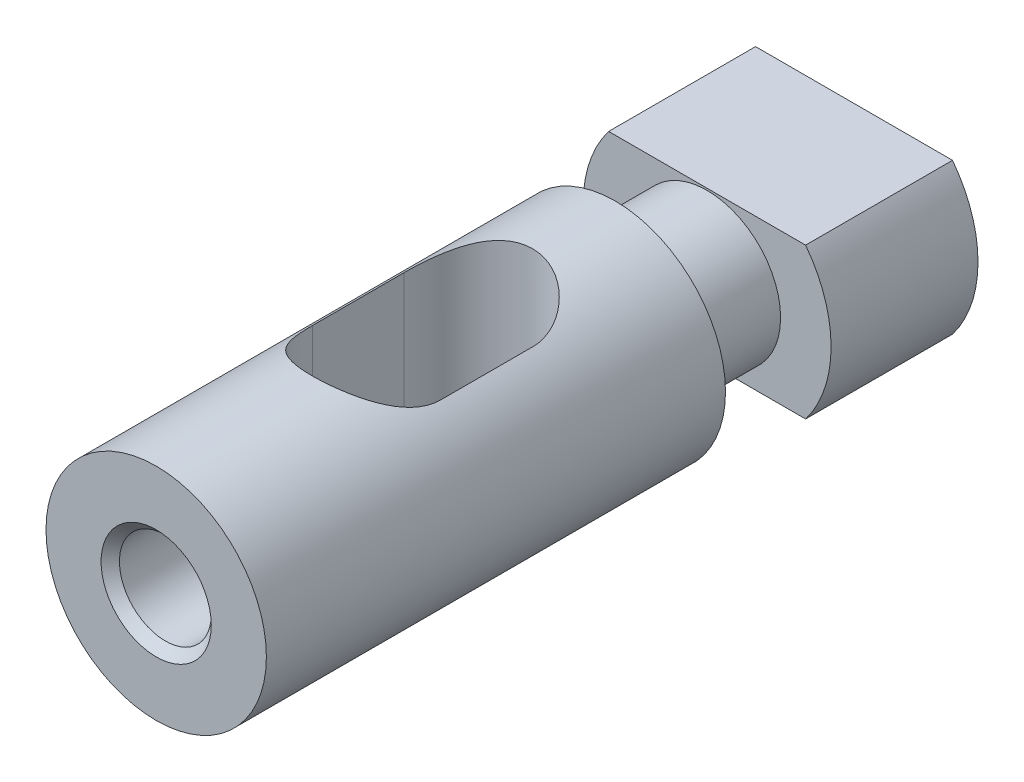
ISO-10303-21;
HEADER;
FILE_DESCRIPTION(('STEP AP214'),'2;1');
FILE_NAME('part.step','',(''),(''),'','','');
FILE_SCHEMA(('AUTOMOTIVE_DESIGN { 1 0 10303 214 1 1 1 1 }'));
ENDSEC;
DATA;
#1=APPLICATION_CONTEXT('core data for automotive mechanical design processes');
#2=APPLICATION_PROTOCOL_DEFINITION('international standard','automotive_design',2000,#1);
#3=PRODUCT_CONTEXT('',#1,'mechanical');
#4=PRODUCT('Part','Part','',(#3));
#5=PRODUCT_RELATED_PRODUCT_CATEGORY('part','',(#4));
#6=PRODUCT_DEFINITION_FORMATION('','',#4);
#7=PRODUCT_DEFINITION_CONTEXT('part definition',#1,'design');
#8=PRODUCT_DEFINITION('design','',#6,#7);
#9=PRODUCT_DEFINITION_SHAPE('','',#8);
#10=(LENGTH_UNIT() NAMED_UNIT(*) SI_UNIT(.MILLI.,.METRE.));
#11=(NAMED_UNIT(*) PLANE_ANGLE_UNIT() SI_UNIT($,.RADIAN.));
#12=(NAMED_UNIT(*) SI_UNIT($,.STERADIAN.) SOLID_ANGLE_UNIT());
#13=UNCERTAINTY_MEASURE_WITH_UNIT(LENGTH_MEASURE(1.E-05),#10,'distance_accuracy_value','');
#14=(GEOMETRIC_REPRESENTATION_CONTEXT(3) GLOBAL_UNCERTAINTY_ASSIGNED_CONTEXT((#13)) GLOBAL_UNIT_ASSIGNED_CONTEXT((#10,
#11,#12)) REPRESENTATION_CONTEXT('',''));
#15=CARTESIAN_POINT('',(0.,0.,0.));
#16=DIRECTION('',(0.,0.,1.));
#17=DIRECTION('',(1.,0.,0.));
#18=AXIS2_PLACEMENT_3D('',#15,#16,#17);
#19=CARTESIAN_POINT('',(0.,-13.,-24.82));
#20=DIRECTION('',(0.,0.,-1.));
#21=DIRECTION('',(-1.,0.,0.));
#22=AXIS2_PLACEMENT_3D('',#19,#20,#21);
#23=PLANE('',#22);
#24=DIRECTION('',(1.,0.,0.));
#25=VECTOR('',#24,1.);
#26=CARTESIAN_POINT('',(0.,-17.1,-24.82));
#27=LINE('',#26,#25);
#28=CARTESIAN_POINT('',(-5.36213576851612,-17.1,-24.82));
#29=VERTEX_POINT('',#28);
#30=CARTESIAN_POINT('',(5.36213576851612,-17.1,-24.82));
#31=VERTEX_POINT('',#30);
#32=EDGE_CURVE('E177',#29,#31,#27,.T.);
#33=ORIENTED_EDGE('',*,*,#32,.F.);
#34=CARTESIAN_POINT('',(0.,-13.,-24.82));
#35=DIRECTION('',(0.,0.,1.));
#36=DIRECTION('',(1.,0.,0.));
#37=AXIS2_PLACEMENT_3D('',#34,#35,#36);
#38=CIRCLE('',#37,6.75);
#39=CARTESIAN_POINT('',(-5.36213576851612,-8.9,-24.82));
#40=VERTEX_POINT('',#39);
#41=EDGE_CURVE('E183',#40,#29,#38,.T.);
#42=ORIENTED_EDGE('',*,*,#41,.F.);
#43=DIRECTION('',(1.,0.,0.));
#44=VECTOR('',#43,1.);
#45=CARTESIAN_POINT('',(0.,-8.9,-24.82));
#46=LINE('',#45,#44);
#47=CARTESIAN_POINT('',(5.36213576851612,-8.9,-24.82));
#48=VERTEX_POINT('',#47);
#49=EDGE_CURVE('E187',#48,#40,#46,.F.);
#50=ORIENTED_EDGE('',*,*,#49,.F.);
#51=CARTESIAN_POINT('',(0.,-13.,-24.82));
#52=DIRECTION('',(0.,0.,1.));
#53=DIRECTION('',(1.,0.,0.));
#54=AXIS2_PLACEMENT_3D('',#51,#52,#53);
#55=CIRCLE('',#54,6.75);
#56=EDGE_CURVE('E172',#31,#48,#55,.T.);
#57=ORIENTED_EDGE('',*,*,#56,.F.);
#58=EDGE_LOOP('',(#33,#42,#50,#57));
#59=FACE_BOUND('',#58,.T.);
#60=ADVANCED_FACE('F32',(#59),#23,.T.);
#61=CARTESIAN_POINT('',(0.,-8.9,-20.82));
#62=DIRECTION('',(0.,1.,0.));
#63=DIRECTION('',(0.,0.,1.));
#64=AXIS2_PLACEMENT_3D('',#61,#62,#63);
#65=PLANE('',#64);
#66=DIRECTION('',(0.,0.,1.));
#67=VECTOR('',#66,1.);
#68=CARTESIAN_POINT('',(-5.36213576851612,-8.9,-20.82));
#69=LINE('',#68,#67);
#70=CARTESIAN_POINT('',(-5.36213576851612,-8.9,-16.82));
#71=VERTEX_POINT('',#70);
#72=EDGE_CURVE('E184',#71,#40,#69,.F.);
#73=ORIENTED_EDGE('',*,*,#72,.F.);
#74=DIRECTION('',(1.,0.,0.));
#75=VECTOR('',#74,1.);
#76=CARTESIAN_POINT('',(0.,-8.9,-16.82));
#77=LINE('',#76,#75);
#78=CARTESIAN_POINT('',(5.36213576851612,-8.9,-16.82));
#79=VERTEX_POINT('',#78);
#80=EDGE_CURVE('E169',#79,#71,#77,.F.);
#81=ORIENTED_EDGE('',*,*,#80,.F.);
#82=DIRECTION('',(0.,0.,1.));
#83=VECTOR('',#82,1.);
#84=CARTESIAN_POINT('',(5.36213576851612,-8.9,-20.82));
#85=LINE('',#84,#83);
#86=EDGE_CURVE('E173',#48,#79,#85,.T.);
#87=ORIENTED_EDGE('',*,*,#86,.F.);
#88=ORIENTED_EDGE('',*,*,#49,.T.);
#89=EDGE_LOOP('',(#73,#81,#87,#88));
#90=FACE_BOUND('',#89,.T.);
#91=ADVANCED_FACE('F291',(#90),#65,.T.);
#92=CARTESIAN_POINT('',(0.,-13.,-20.82));
#93=DIRECTION('',(0.,0.,1.));
#94=DIRECTION('',(1.,0.,0.));
#95=AXIS2_PLACEMENT_3D('',#92,#93,#94);
#96=CYLINDRICAL_SURFACE('',#95,6.75);
#97=DIRECTION('',(0.,0.,-1.));
#98=VECTOR('',#97,1.);
#99=CARTESIAN_POINT('',(-5.36213576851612,-17.1,-20.82));
#100=LINE('',#99,#98);
#101=CARTESIAN_POINT('',(-5.36213576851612,-17.1,-16.82));
#102=VERTEX_POINT('',#101);
#103=EDGE_CURVE('E180',#102,#29,#100,.T.);
#104=ORIENTED_EDGE('',*,*,#103,.F.);
#105=CARTESIAN_POINT('',(0.,-13.,-16.82));
#106=DIRECTION('',(0.,0.,1.));
#107=DIRECTION('',(1.,0.,0.));
#108=AXIS2_PLACEMENT_3D('',#105,#106,#107);
#109=CIRCLE('',#108,6.75);
#110=EDGE_CURVE('E168',#71,#102,#109,.T.);
#111=ORIENTED_EDGE('',*,*,#110,.F.);
#112=ORIENTED_EDGE('',*,*,#72,.T.);
#113=ORIENTED_EDGE('',*,*,#41,.T.);
#114=EDGE_LOOP('',(#104,#111,#112,#113));
#115=FACE_BOUND('',#114,.T.);
#116=ADVANCED_FACE('F288',(#115),#96,.T.);
#117=CARTESIAN_POINT('',(0.,-17.1,-20.82));
#118=DIRECTION('',(0.,-1.,0.));
#119=DIRECTION('',(0.,0.,-1.));
#120=AXIS2_PLACEMENT_3D('',#117,#118,#119);
#121=PLANE('',#120);
#122=DIRECTION('',(0.,0.,1.));
#123=VECTOR('',#122,1.);
#124=CARTESIAN_POINT('',(5.36213576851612,-17.1,-20.82));
#125=LINE('',#124,#123);
#126=CARTESIAN_POINT('',(5.36213576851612,-17.1,-16.82));
#127=VERTEX_POINT('',#126);
#128=EDGE_CURVE('E176',#127,#31,#125,.F.);
#129=ORIENTED_EDGE('',*,*,#128,.F.);
#130=DIRECTION('',(1.,0.,0.));
#131=VECTOR('',#130,1.);
#132=CARTESIAN_POINT('',(0.,-17.1,-16.82));
#133=LINE('',#132,#131);
#134=EDGE_CURVE('E164',#102,#127,#133,.T.);
#135=ORIENTED_EDGE('',*,*,#134,.F.);
#136=ORIENTED_EDGE('',*,*,#103,.T.);
#137=ORIENTED_EDGE('',*,*,#32,.T.);
#138=EDGE_LOOP('',(#129,#135,#136,#137));
#139=FACE_BOUND('',#138,.T.);
#140=ADVANCED_FACE('F284',(#139),#121,.T.);
#141=CARTESIAN_POINT('',(0.,-13.,-20.82));
#142=DIRECTION('',(0.,0.,1.));
#143=DIRECTION('',(1.,0.,0.));
#144=AXIS2_PLACEMENT_3D('',#141,#142,#143);
#145=CYLINDRICAL_SURFACE('',#144,6.75);
#146=ORIENTED_EDGE('',*,*,#128,.T.);
#147=ORIENTED_EDGE('',*,*,#56,.T.);
#148=ORIENTED_EDGE('',*,*,#86,.T.);
#149=CARTESIAN_POINT('',(0.,-13.,-16.82));
#150=DIRECTION('',(0.,0.,1.));
#151=DIRECTION('',(1.,0.,0.));
#152=AXIS2_PLACEMENT_3D('',#149,#150,#151);
#153=CIRCLE('',#152,6.75);
#154=EDGE_CURVE('E167',#127,#79,#153,.T.);
#155=ORIENTED_EDGE('',*,*,#154,.F.);
#156=EDGE_LOOP('',(#146,#147,#148,#155));
#157=FACE_BOUND('',#156,.T.);
#158=ADVANCED_FACE('F280',(#157),#145,.T.);
#159=CARTESIAN_POINT('',(0.,-13.,-16.82));
#160=DIRECTION('',(0.,0.,1.));
#161=DIRECTION('',(1.,0.,0.));
#162=AXIS2_PLACEMENT_3D('',#159,#160,#161);
#163=PLANE('',#162);
#164=CARTESIAN_POINT('',(0.,-13.,-16.82));
#165=DIRECTION('',(0.,0.,1.));
#166=DIRECTION('',(1.,0.,0.));
#167=AXIS2_PLACEMENT_3D('',#164,#165,#166);
#168=CIRCLE('',#167,4.);
#169=CARTESIAN_POINT('',(4.,-13.,-16.82));
#170=VERTEX_POINT('',#169);
#171=EDGE_CURVE('E163',#170,#170,#168,.T.);
#172=ORIENTED_EDGE('',*,*,#171,.F.);
#173=EDGE_LOOP('',(#172));
#174=FACE_BOUND('',#173,.T.);
#175=ORIENTED_EDGE('',*,*,#134,.T.);
#176=ORIENTED_EDGE('',*,*,#154,.T.);
#177=ORIENTED_EDGE('',*,*,#80,.T.);
#178=ORIENTED_EDGE('',*,*,#110,.T.);
#179=EDGE_LOOP('',(#175,#176,#177,#178));
#180=FACE_BOUND('',#179,.T.);
#181=ADVANCED_FACE('F276',(#174,#180),#163,.T.);
#182=CARTESIAN_POINT('',(0.,-13.,4.17999999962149));
#183=DIRECTION('',(0.,0.,-1.));
#184=DIRECTION('',(-1.,0.,0.));
#185=AXIS2_PLACEMENT_3D('',#182,#183,#184);
#186=CONICAL_SURFACE('',#185,2.99999999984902,0.785398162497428);
#187=CARTESIAN_POINT('',(0.,-13.,4.68000000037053));
#188=DIRECTION('',(0.,0.,-1.));
#189=DIRECTION('',(-1.,0.,0.));
#190=AXIS2_PLACEMENT_3D('',#187,#188,#189);
#191=CIRCLE('',#190,2.5);
#192=CARTESIAN_POINT('',(-2.5,-13.,4.68000000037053));
#193=VERTEX_POINT('',#192);
#194=EDGE_CURVE('E190',#193,#193,#191,.F.);
#195=ORIENTED_EDGE('',*,*,#194,.T.);
#196=EDGE_LOOP('',(#195));
#197=FACE_BOUND('',#196,.T.);
#198=CARTESIAN_POINT('',(0.,-13.,4.17999999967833));
#199=DIRECTION('',(0.,0.,-1.));
#200=DIRECTION('',(-1.,0.,0.));
#201=AXIS2_PLACEMENT_3D('',#198,#199,#200);
#202=CIRCLE('',#201,2.99999999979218);
#203=CARTESIAN_POINT('',(-1.802775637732,-15.3979157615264,4.17999999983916));
#204=VERTEX_POINT('',#203);
#205=CARTESIAN_POINT('',(-1.80277563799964,-10.6020842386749,4.17999999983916));
#206=VERTEX_POINT('',#205);
#207=EDGE_CURVE('E159',#204,#206,#202,.T.);
#208=ORIENTED_EDGE('',*,*,#207,.T.);
#209=CARTESIAN_POINT('',(0.,-13.,4.18));
#210=DIRECTION('',(0.,0.,1.));
#211=DIRECTION('',(1.,0.,0.));
#212=AXIS2_PLACEMENT_3D('',#209,#210,#211);
#213=CIRCLE('',#212,3.);
#214=CARTESIAN_POINT('',(1.80277563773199,-10.6020842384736,4.17999999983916));
#215=VERTEX_POINT('',#214);
#216=EDGE_CURVE('E155',#215,#206,#213,.T.);
#217=ORIENTED_EDGE('',*,*,#216,.F.);
#218=CARTESIAN_POINT('',(0.,-13.,4.17999999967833));
#219=DIRECTION('',(0.,0.,-1.));
#220=DIRECTION('',(-1.,0.,0.));
#221=AXIS2_PLACEMENT_3D('',#218,#219,#220);
#222=CIRCLE('',#221,2.99999999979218);
#223=CARTESIAN_POINT('',(1.80277563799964,-15.3979157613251,4.17999999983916));
#224=VERTEX_POINT('',#223);
#225=EDGE_CURVE('E158',#215,#224,#222,.T.);
#226=ORIENTED_EDGE('',*,*,#225,.T.);
#227=CARTESIAN_POINT('',(0.,-13.,4.18));
#228=DIRECTION('',(0.,0.,1.));
#229=DIRECTION('',(1.,0.,0.));
#230=AXIS2_PLACEMENT_3D('',#227,#228,#229);
#231=CIRCLE('',#230,3.);
#232=EDGE_CURVE('E160',#204,#224,#231,.T.);
#233=ORIENTED_EDGE('',*,*,#232,.F.);
#234=EDGE_LOOP('',(#208,#217,#226,#233));
#235=FACE_BOUND('',#234,.T.);
#236=ADVANCED_FACE('F272',(#197,#235),#186,.F.);
#237=CARTESIAN_POINT('',(0.,-13.,-14.32));
#238=DIRECTION('',(0.,0.,1.));
#239=DIRECTION('',(1.,0.,0.));
#240=AXIS2_PLACEMENT_3D('',#237,#238,#239);
#241=CYLINDRICAL_SURFACE('',#240,4.);
#242=CARTESIAN_POINT('',(0.,-13.,-11.82));
#243=DIRECTION('',(0.,0.,1.));
#244=DIRECTION('',(1.,0.,0.));
#245=AXIS2_PLACEMENT_3D('',#242,#243,#244);
#246=CIRCLE('',#245,4.);
#247=CARTESIAN_POINT('',(4.,-13.,-11.82));
#248=VERTEX_POINT('',#247);
#249=EDGE_CURVE('E319',#248,#248,#246,.T.);
#250=ORIENTED_EDGE('',*,*,#249,.F.);
#251=EDGE_LOOP('',(#250));
#252=FACE_BOUND('',#251,.T.);
#253=ORIENTED_EDGE('',*,*,#171,.T.);
#254=EDGE_LOOP('',(#253));
#255=FACE_BOUND('',#254,.T.);
#256=ADVANCED_FACE('F268',(#252,#255),#241,.T.);
#257=CARTESIAN_POINT('',(0.,-13.,13.1800000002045));
#258=DIRECTION('',(0.,0.,1.));
#259=DIRECTION('',(1.,0.,0.));
#260=AXIS2_PLACEMENT_3D('',#257,#258,#259);
#261=CONICAL_SURFACE('',#260,2.99999999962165,0.785398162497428);
#262=CARTESIAN_POINT('',(0.,-13.,12.6799999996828));
#263=DIRECTION('',(0.,0.,1.));
#264=DIRECTION('',(1.,0.,0.));
#265=AXIS2_PLACEMENT_3D('',#262,#263,#264);
#266=CIRCLE('',#265,2.5);
#267=CARTESIAN_POINT('',(2.5,-13.,12.6799999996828));
#268=VERTEX_POINT('',#267);
#269=EDGE_CURVE('E355',#268,#268,#266,.F.);
#270=ORIENTED_EDGE('',*,*,#269,.T.);
#271=EDGE_LOOP('',(#270));
#272=FACE_BOUND('',#271,.T.);
#273=CARTESIAN_POINT('',(0.,-13.,13.1800000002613));
#274=DIRECTION('',(0.,0.,1.));
#275=DIRECTION('',(1.,0.,0.));
#276=AXIS2_PLACEMENT_3D('',#273,#274,#275);
#277=CIRCLE('',#276,2.99999999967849);
#278=CARTESIAN_POINT('',(2.99999999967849,-13.,13.1800000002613));
#279=VERTEX_POINT('',#278);
#280=EDGE_CURVE('E154',#279,#279,#277,.F.);
#281=ORIENTED_EDGE('',*,*,#280,.F.);
#282=EDGE_LOOP('',(#281));
#283=FACE_BOUND('',#282,.T.);
#284=ADVANCED_FACE('F264',(#272,#283),#261,.F.);
#285=CARTESIAN_POINT('',(0.,-13.,8.68));
#286=DIRECTION('',(0.,0.,1.));
#287=DIRECTION('',(1.,0.,0.));
#288=AXIS2_PLACEMENT_3D('',#285,#286,#287);
#289=CYLINDRICAL_SURFACE('',#288,3.);
#290=CARTESIAN_POINT('',(1.80277563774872,-15.3979157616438,4.17999999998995));
#291=CARTESIAN_POINT('',(1.74748096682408,-15.4394730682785,4.21322082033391));
#292=CARTESIAN_POINT('',(1.69040270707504,-15.4794017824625,4.24544364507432));
#293=CARTESIAN_POINT('',(1.57261891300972,-15.5557436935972,4.30751121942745));
#294=CARTESIAN_POINT('',(1.51190975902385,-15.5921532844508,4.33735352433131));
#295=CARTESIAN_POINT('',(1.32353740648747,-15.6960796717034,4.42303782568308));
#296=CARTESIAN_POINT('',(1.19041008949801,-15.7576981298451,4.47455585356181));
#297=CARTESIAN_POINT('',(0.981394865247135,-15.8359265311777,4.54039951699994));
#298=CARTESIAN_POINT('',(0.909881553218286,-15.8596985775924,4.56049573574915));
#299=CARTESIAN_POINT('',(0.764278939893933,-15.9020014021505,4.59635549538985));
#300=CARTESIAN_POINT('',(0.690191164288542,-15.9205352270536,4.61212155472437));
#301=CARTESIAN_POINT('',(0.540254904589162,-15.9519431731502,4.63888726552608));
#302=CARTESIAN_POINT('',(0.464413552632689,-15.9648370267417,4.64990353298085));
#303=CARTESIAN_POINT('',(0.31144368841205,-15.9847886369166,4.666966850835));
#304=CARTESIAN_POINT('',(0.234315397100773,-15.9918473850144,4.67301474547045));
#305=CARTESIAN_POINT('',(0.0209882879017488,-16.0029990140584,4.68256760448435));
#306=CARTESIAN_POINT('',(-0.11587245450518,-16.0008358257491,4.68071105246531));
#307=CARTESIAN_POINT('',(-0.386895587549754,-15.9780624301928,4.66121019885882));
#308=CARTESIAN_POINT('',(-0.521056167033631,-15.9574402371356,4.64355563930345));
#309=CARTESIAN_POINT('',(-0.776333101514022,-15.9006159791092,4.59516676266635));
#310=CARTESIAN_POINT('',(-0.897766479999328,-15.8652301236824,4.5651185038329));
#311=CARTESIAN_POINT('',(-1.13243389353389,-15.7808558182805,4.49400729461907));
#312=CARTESIAN_POINT('',(-1.24566215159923,-15.7318578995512,4.45293667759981));
#313=CARTESIAN_POINT('',(-1.4344486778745,-15.6363795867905,4.37374047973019));
#314=CARTESIAN_POINT('',(-1.51219453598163,-15.5925049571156,4.33758392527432));
#315=CARTESIAN_POINT('',(-1.66182603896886,-15.499213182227,4.26145393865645));
#316=CARTESIAN_POINT('',(-1.7337331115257,-15.4498180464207,4.22149575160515));
#317=CARTESIAN_POINT('',(-1.80277563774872,-15.3979157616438,4.17999999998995));
#318=B_SPLINE_CURVE_WITH_KNOTS('',3,(#290,#291,#292,#293,#294,#295,#296,#297,#298,#299,#300,
#301,#302,#303,#304,#305,#306,#307,#308,#309,#310,#311,#312,#313,#314,#315,#316,#317),
.UNSPECIFIED.,.F.,.F.,(4,2,2,2,2,2,2,2,2,2,2,2,2,4),(0.,0.230085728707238,0.460404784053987,
0.924293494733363,1.15800730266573,1.39158489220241,1.62433860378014,1.85705275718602,
2.26534952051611,2.67391159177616,3.06237795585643,3.45111522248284,3.73966440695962,
4.02710167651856),.UNSPECIFIED.);
#319=EDGE_CURVE('E139',#224,#204,#318,.T.);
#320=ORIENTED_EDGE('',*,*,#319,.T.);
#321=ORIENTED_EDGE('',*,*,#232,.T.);
#322=EDGE_LOOP('',(#320,#321));
#323=FACE_BOUND('',#322,.T.);
#324=ADVANCED_FACE('F259',(#323),#289,.T.);
#325=CARTESIAN_POINT('',(0.,-11.5,4.18));
#326=DIRECTION('',(0.,0.,-1.));
#327=DIRECTION('',(-1.,0.,0.));
#328=AXIS2_PLACEMENT_3D('',#325,#326,#327);
#329=PLANE('',#328);
#330=DIRECTION('',(0.,1.,0.));
#331=VECTOR('',#330,1.);
#332=CARTESIAN_POINT('',(-1.802775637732,0.,4.18));
#333=LINE('',#332,#331);
#334=CARTESIAN_POINT('',(-1.802775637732,-14.7320508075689,4.18));
#335=VERTEX_POINT('',#334);
#336=EDGE_CURVE('E144',#204,#335,#333,.T.);
#337=ORIENTED_EDGE('',*,*,#336,.T.);
#338=CARTESIAN_POINT('',(0.,-13.,4.18));
#339=DIRECTION('',(0.,0.,-1.));
#340=DIRECTION('',(-1.,0.,0.));
#341=AXIS2_PLACEMENT_3D('',#338,#339,#340);
#342=CIRCLE('',#341,2.5);
#343=CARTESIAN_POINT('',(-1.802775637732,-11.2679491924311,4.18));
#344=VERTEX_POINT('',#343);
#345=EDGE_CURVE('E56',#335,#344,#342,.T.);
#346=ORIENTED_EDGE('',*,*,#345,.T.);
#347=EDGE_CURVE('E151',#344,#206,#333,.T.);
#348=ORIENTED_EDGE('',*,*,#347,.T.);
#349=ORIENTED_EDGE('',*,*,#207,.F.);
#350=EDGE_LOOP('',(#337,#346,#348,#349));
#351=FACE_BOUND('',#350,.T.);
#352=ADVANCED_FACE('F255',(#351),#329,.F.);
#353=CARTESIAN_POINT('',(0.,-13.,8.68));
#354=DIRECTION('',(0.,0.,1.));
#355=DIRECTION('',(1.,0.,0.));
#356=AXIS2_PLACEMENT_3D('',#353,#354,#355);
#357=CYLINDRICAL_SURFACE('',#356,3.);
#358=CARTESIAN_POINT('',(-1.80277563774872,-10.6020842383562,4.17999999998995));
#359=CARTESIAN_POINT('',(-1.74748096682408,-10.5605269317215,4.21322082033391));
#360=CARTESIAN_POINT('',(-1.69040270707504,-10.5205982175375,4.24544364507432));
#361=CARTESIAN_POINT('',(-1.57261891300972,-10.4442563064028,4.30751121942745));
#362=CARTESIAN_POINT('',(-1.51190975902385,-10.4078467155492,4.33735352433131));
#363=CARTESIAN_POINT('',(-1.32353740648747,-10.3039203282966,4.42303782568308));
#364=CARTESIAN_POINT('',(-1.19041008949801,-10.2423018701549,4.47455585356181));
#365=CARTESIAN_POINT('',(-0.981394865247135,-10.1640734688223,4.54039951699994));
#366=CARTESIAN_POINT('',(-0.909881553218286,-10.1403014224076,4.56049573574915));
#367=CARTESIAN_POINT('',(-0.764278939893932,-10.0979985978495,4.59635549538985));
#368=CARTESIAN_POINT('',(-0.690191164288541,-10.0794647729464,4.61212155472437));
#369=CARTESIAN_POINT('',(-0.540254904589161,-10.0480568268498,4.63888726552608));
#370=CARTESIAN_POINT('',(-0.464413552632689,-10.0351629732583,4.64990353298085));
#371=CARTESIAN_POINT('',(-0.31144368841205,-10.0152113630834,4.666966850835));
#372=CARTESIAN_POINT('',(-0.234315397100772,-10.0081526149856,4.67301474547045));
#373=CARTESIAN_POINT('',(-0.0209882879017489,-9.99700098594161,4.68256760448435));
#374=CARTESIAN_POINT('',(0.11587245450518,-9.99916417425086,4.68071105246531));
#375=CARTESIAN_POINT('',(0.386895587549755,-10.0219375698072,4.66121019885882));
#376=CARTESIAN_POINT('',(0.521056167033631,-10.0425597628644,4.64355563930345));
#377=CARTESIAN_POINT('',(0.776333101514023,-10.0993840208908,4.59516676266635));
#378=CARTESIAN_POINT('',(0.89776647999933,-10.1347698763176,4.5651185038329));
#379=CARTESIAN_POINT('',(1.13243389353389,-10.2191441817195,4.49400729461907));
#380=CARTESIAN_POINT('',(1.24566215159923,-10.2681421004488,4.45293667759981));
#381=CARTESIAN_POINT('',(1.4344486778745,-10.3636204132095,4.37374047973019));
#382=CARTESIAN_POINT('',(1.51219453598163,-10.4074950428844,4.33758392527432));
#383=CARTESIAN_POINT('',(1.66182603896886,-10.500786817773,4.26145393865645));
#384=CARTESIAN_POINT('',(1.7337331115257,-10.5501819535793,4.22149575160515));
#385=CARTESIAN_POINT('',(1.80277563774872,-10.6020842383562,4.17999999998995));
#386=B_SPLINE_CURVE_WITH_KNOTS('',3,(#358,#359,#360,#361,#362,#363,#364,#365,#366,#367,#368,
#369,#370,#371,#372,#373,#374,#375,#376,#377,#378,#379,#380,#381,#382,#383,#384,#385),
.UNSPECIFIED.,.F.,.F.,(4,2,2,2,2,2,2,2,2,2,2,2,2,4),(0.,0.230085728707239,0.460404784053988,
0.924293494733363,1.15800730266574,1.39158489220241,1.62433860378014,1.85705275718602,
2.26534952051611,2.67391159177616,3.06237795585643,3.45111522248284,3.73966440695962,
4.02710167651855),.UNSPECIFIED.);
#387=EDGE_CURVE('E140',#206,#215,#386,.T.);
#388=ORIENTED_EDGE('',*,*,#387,.T.);
#389=ORIENTED_EDGE('',*,*,#216,.T.);
#390=EDGE_LOOP('',(#388,#389));
#391=FACE_BOUND('',#390,.T.);
#392=ADVANCED_FACE('F250',(#391),#357,.T.);
#393=CARTESIAN_POINT('',(0.,-11.5,4.18));
#394=DIRECTION('',(0.,0.,-1.));
#395=DIRECTION('',(-1.,0.,0.));
#396=AXIS2_PLACEMENT_3D('',#393,#394,#395);
#397=PLANE('',#396);
#398=DIRECTION('',(0.,1.,0.));
#399=VECTOR('',#398,1.);
#400=CARTESIAN_POINT('',(1.802775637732,0.,4.18));
#401=LINE('',#400,#399);
#402=CARTESIAN_POINT('',(1.802775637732,-11.2679491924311,4.18));
#403=VERTEX_POINT('',#402);
#404=EDGE_CURVE('E131',#215,#403,#401,.F.);
#405=ORIENTED_EDGE('',*,*,#404,.T.);
#406=CARTESIAN_POINT('',(0.,-13.,4.18));
#407=DIRECTION('',(0.,0.,-1.));
#408=DIRECTION('',(-1.,0.,0.));
#409=AXIS2_PLACEMENT_3D('',#406,#407,#408);
#410=CIRCLE('',#409,2.5);
#411=CARTESIAN_POINT('',(1.802775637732,-14.7320508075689,4.18));
#412=VERTEX_POINT('',#411);
#413=EDGE_CURVE('E49',#403,#412,#410,.T.);
#414=ORIENTED_EDGE('',*,*,#413,.T.);
#415=EDGE_CURVE('E129',#412,#224,#401,.F.);
#416=ORIENTED_EDGE('',*,*,#415,.T.);
#417=ORIENTED_EDGE('',*,*,#225,.F.);
#418=EDGE_LOOP('',(#405,#414,#416,#417));
#419=FACE_BOUND('',#418,.T.);
#420=ADVANCED_FACE('F127',(#419),#397,.F.);
#421=CARTESIAN_POINT('',(0.,-13.,-11.82));
#422=DIRECTION('',(0.,0.,-1.));
#423=DIRECTION('',(-1.,0.,0.));
#424=AXIS2_PLACEMENT_3D('',#421,#422,#423);
#425=PLANE('',#424);
#426=ORIENTED_EDGE('',*,*,#249,.T.);
#427=EDGE_LOOP('',(#426));
#428=FACE_BOUND('',#427,.T.);
#429=CARTESIAN_POINT('',(0.,-13.,-11.82));
#430=DIRECTION('',(0.,0.,1.));
#431=DIRECTION('',(1.,0.,0.));
#432=AXIS2_PLACEMENT_3D('',#429,#430,#431);
#433=CIRCLE('',#432,6.);
#434=CARTESIAN_POINT('',(6.,-13.,-11.82));
#435=VERTEX_POINT('',#434);
#436=EDGE_CURVE('E249',#435,#435,#433,.T.);
#437=ORIENTED_EDGE('',*,*,#436,.F.);
#438=EDGE_LOOP('',(#437));
#439=FACE_BOUND('',#438,.T.);
#440=ADVANCED_FACE('F328',(#428,#439),#425,.T.);
#441=CARTESIAN_POINT('',(0.,-13.,13.18));
#442=DIRECTION('',(0.,0.,1.));
#443=DIRECTION('',(1.,0.,0.));
#444=AXIS2_PLACEMENT_3D('',#441,#442,#443);
#445=PLANE('',#444);
#446=ORIENTED_EDGE('',*,*,#280,.T.);
#447=EDGE_LOOP('',(#446));
#448=FACE_BOUND('',#447,.T.);
#449=CARTESIAN_POINT('',(0.,-13.,13.18));
#450=DIRECTION('',(0.,0.,1.));
#451=DIRECTION('',(1.,0.,0.));
#452=AXIS2_PLACEMENT_3D('',#449,#450,#451);
#453=CIRCLE('',#452,6.);
#454=CARTESIAN_POINT('',(6.,-13.,13.18));
#455=VERTEX_POINT('',#454);
#456=EDGE_CURVE('E331',#455,#455,#453,.F.);
#457=ORIENTED_EDGE('',*,*,#456,.F.);
#458=EDGE_LOOP('',(#457));
#459=FACE_BOUND('',#458,.T.);
#460=ADVANCED_FACE('F324',(#448,#459),#445,.T.);
#461=CARTESIAN_POINT('',(-3.5,0.,-1.32));
#462=DIRECTION('',(1.,0.,0.));
#463=DIRECTION('',(0.,0.,-1.));
#464=AXIS2_PLACEMENT_3D('',#461,#462,#463);
#465=PLANE('',#464);
#466=DIRECTION('',(0.,0.,1.));
#467=VECTOR('',#466,1.);
#468=CARTESIAN_POINT('',(-3.5,-8.12660282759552,0.68));
#469=LINE('',#468,#467);
#470=CARTESIAN_POINT('',(-3.5,-8.12660282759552,1.18));
#471=VERTEX_POINT('',#470);
#472=CARTESIAN_POINT('',(-3.5,-8.12660282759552,-3.82));
#473=VERTEX_POINT('',#472);
#474=EDGE_CURVE('E333',#471,#473,#469,.F.);
#475=ORIENTED_EDGE('',*,*,#474,.F.);
#476=DIRECTION('',(0.,1.,0.));
#477=VECTOR('',#476,1.);
#478=CARTESIAN_POINT('',(-3.5,0.,1.18));
#479=LINE('',#478,#477);
#480=CARTESIAN_POINT('',(-3.5,-17.8733971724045,1.18));
#481=VERTEX_POINT('',#480);
#482=EDGE_CURVE('E152',#471,#481,#479,.F.);
#483=ORIENTED_EDGE('',*,*,#482,.T.);
#484=DIRECTION('',(0.,0.,1.));
#485=VECTOR('',#484,1.);
#486=CARTESIAN_POINT('',(-3.5,-17.8733971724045,0.68));
#487=LINE('',#486,#485);
#488=CARTESIAN_POINT('',(-3.5,-17.8733971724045,-3.82));
#489=VERTEX_POINT('',#488);
#490=EDGE_CURVE('E226',#489,#481,#487,.T.);
#491=ORIENTED_EDGE('',*,*,#490,.F.);
#492=DIRECTION('',(0.,1.,0.));
#493=VECTOR('',#492,1.);
#494=CARTESIAN_POINT('',(-3.5,0.,-3.82));
#495=LINE('',#494,#493);
#496=EDGE_CURVE('E337',#489,#473,#495,.T.);
#497=ORIENTED_EDGE('',*,*,#496,.T.);
#498=EDGE_LOOP('',(#475,#483,#491,#497));
#499=FACE_BOUND('',#498,.T.);
#500=ADVANCED_FACE('F232',(#499),#465,.T.);
#501=CARTESIAN_POINT('',(0.,0.,1.18));
#502=DIRECTION('',(0.,1.,0.));
#503=DIRECTION('',(0.,0.,1.));
#504=AXIS2_PLACEMENT_3D('',#501,#502,#503);
#505=CYLINDRICAL_SURFACE('',#504,3.5);
#506=ORIENTED_EDGE('',*,*,#347,.F.);
#507=CARTESIAN_POINT('',(2.5,-13.,3.62948974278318));
#508=CARTESIAN_POINT('',(2.50000008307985,-12.9404562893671,3.62948953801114));
#509=CARTESIAN_POINT('',(2.49786660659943,-12.8809135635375,3.63167349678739));
#510=CARTESIAN_POINT('',(2.48939639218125,-12.7624244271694,3.64027192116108));
#511=CARTESIAN_POINT('',(2.48305754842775,-12.7034783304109,3.64668850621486));
#512=CARTESIAN_POINT('',(2.45790532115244,-12.5281861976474,3.67184493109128));
#513=CARTESIAN_POINT('',(2.43295665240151,-12.4135019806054,3.69649044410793));
#514=CARTESIAN_POINT('',(2.36895101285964,-12.193055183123,3.75680751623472));
#515=CARTESIAN_POINT('',(2.33006279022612,-12.0872038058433,3.79234648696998));
#516=CARTESIAN_POINT('',(2.23974108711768,-11.8837834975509,3.87018993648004));
#517=CARTESIAN_POINT('',(2.18830809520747,-11.7862142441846,3.91249415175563));
#518=CARTESIAN_POINT('',(2.06335507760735,-11.5824803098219,4.00839883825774));
#519=CARTESIAN_POINT('',(1.98751158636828,-11.4780440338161,4.06264452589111));
#520=CARTESIAN_POINT('',(1.82058511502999,-11.2818325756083,4.17088930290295));
#521=CARTESIAN_POINT('',(1.72948196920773,-11.1900744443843,4.22488796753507));
#522=CARTESIAN_POINT('',(1.51515057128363,-11.0056036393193,4.33775040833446));
#523=CARTESIAN_POINT('',(1.38909031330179,-10.9155857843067,4.39578851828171));
#524=CARTESIAN_POINT('',(1.1865546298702,-10.7981412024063,4.47353038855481));
#525=CARTESIAN_POINT('',(1.11682337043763,-10.7619310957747,4.49788625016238));
#526=CARTESIAN_POINT('',(0.973261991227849,-10.6958730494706,4.54279808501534));
#527=CARTESIAN_POINT('',(0.899433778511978,-10.6660221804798,4.56335580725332));
#528=CARTESIAN_POINT('',(0.714757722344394,-10.6015763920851,4.60807195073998));
#529=CARTESIAN_POINT('',(0.601969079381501,-10.5707152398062,4.62980641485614));
#530=CARTESIAN_POINT('',(0.371714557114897,-10.5250070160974,4.66214426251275));
#531=CARTESIAN_POINT('',(0.254252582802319,-10.5101468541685,4.67275674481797));
#532=CARTESIAN_POINT('',(0.0176657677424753,-10.4972525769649,4.68195986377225));
#533=CARTESIAN_POINT('',(-0.101462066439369,-10.4992541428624,4.68052500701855));
#534=CARTESIAN_POINT('',(-0.337487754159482,-10.5200508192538,4.66569879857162));
#535=CARTESIAN_POINT('',(-0.454385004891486,-10.538850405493,4.65230426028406));
#536=CARTESIAN_POINT('',(-0.679693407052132,-10.5914602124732,4.61521875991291));
#537=CARTESIAN_POINT('',(-0.788246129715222,-10.6248677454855,4.59180435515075));
#538=CARTESIAN_POINT('',(-0.997932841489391,-10.7050610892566,4.53647199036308));
#539=CARTESIAN_POINT('',(-1.09906531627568,-10.751849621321,4.50455230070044));
#540=CARTESIAN_POINT('',(-1.30329917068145,-10.863085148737,4.43030712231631));
#541=CARTESIAN_POINT('',(-1.40536259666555,-10.9289194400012,4.38721819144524));
#542=CARTESIAN_POINT('',(-1.59757774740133,-11.0732875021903,4.29594156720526));
#543=CARTESIAN_POINT('',(-1.68771722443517,-11.1518341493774,4.247748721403));
#544=CARTESIAN_POINT('',(-1.87089930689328,-11.3357969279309,4.14023300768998));
#545=CARTESIAN_POINT('',(-1.9614108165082,-11.4434968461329,4.0804967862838));
#546=CARTESIAN_POINT('',(-2.12378275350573,-11.6735890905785,3.96379679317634));
#547=CARTESIAN_POINT('',(-2.1956442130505,-11.7959806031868,3.90683286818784));
#548=CARTESIAN_POINT('',(-2.3049168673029,-12.0254897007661,3.814628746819));
#549=CARTESIAN_POINT('',(-2.34644193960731,-12.1298373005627,3.77738554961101));
#550=CARTESIAN_POINT('',(-2.415614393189,-12.3460827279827,3.71319135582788));
#551=CARTESIAN_POINT('',(-2.44328746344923,-12.4579661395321,3.6862213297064));
#552=CARTESIAN_POINT('',(-2.47322196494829,-12.6303388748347,3.65656322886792));
#553=CARTESIAN_POINT('',(-2.48128458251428,-12.6889460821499,3.64846022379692));
#554=CARTESIAN_POINT('',(-2.49324280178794,-12.8069930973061,3.63638264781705));
#555=CARTESIAN_POINT('',(-2.49714067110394,-12.8664324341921,3.63240583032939));
#556=CARTESIAN_POINT('',(-2.50066795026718,-12.9855507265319,3.6288092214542));
#557=CARTESIAN_POINT('',(-2.50029884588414,-13.0452295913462,3.62918791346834));
#558=CARTESIAN_POINT('',(-2.4953128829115,-13.1642064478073,3.63426632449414));
#559=CARTESIAN_POINT('',(-2.49069628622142,-13.2235044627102,3.63896577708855));
#560=CARTESIAN_POINT('',(-2.47275078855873,-13.3813123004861,3.65704963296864));
#561=CARTESIAN_POINT('',(-2.45562809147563,-13.4789958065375,3.67417067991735));
#562=CARTESIAN_POINT('',(-2.41064047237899,-13.6696687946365,3.71767095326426));
#563=CARTESIAN_POINT('',(-2.38276290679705,-13.7626526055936,3.74406107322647));
#564=CARTESIAN_POINT('',(-2.3016215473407,-13.986250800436,3.81757068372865));
#565=CARTESIAN_POINT('',(-2.24259540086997,-14.1135026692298,3.86855983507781));
#566=CARTESIAN_POINT('',(-2.10582573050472,-14.3545398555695,3.97698788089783));
#567=CARTESIAN_POINT('',(-2.02804474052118,-14.468297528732,4.03443956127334));
#568=CARTESIAN_POINT('',(-1.85312784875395,-14.6839251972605,4.15106517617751));
#569=CARTESIAN_POINT('',(-1.75559315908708,-14.7854672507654,4.21024862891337));
#570=CARTESIAN_POINT('',(-1.54331688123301,-14.9718180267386,4.32366363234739));
#571=CARTESIAN_POINT('',(-1.42859939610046,-15.0566498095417,4.3779019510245));
#572=CARTESIAN_POINT('',(-1.20143678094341,-15.1958044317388,4.46926160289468));
#573=CARTESIAN_POINT('',(-1.09116965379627,-15.252784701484,4.50772826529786));
#574=CARTESIAN_POINT('',(-0.860760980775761,-15.3504714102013,4.57462004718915));
#575=CARTESIAN_POINT('',(-0.740625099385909,-15.3911871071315,4.60305087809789));
#576=CARTESIAN_POINT('',(-0.492513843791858,-15.4543643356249,4.64747658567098));
#577=CARTESIAN_POINT('',(-0.364493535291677,-15.4767083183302,4.66339135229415));
#578=CARTESIAN_POINT('',(-0.105575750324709,-15.5011461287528,4.68080759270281));
#579=CARTESIAN_POINT('',(0.0253201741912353,-15.5032506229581,4.68231665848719));
#580=CARTESIAN_POINT('',(0.271149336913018,-15.4879711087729,4.67141567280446));
#581=CARTESIAN_POINT('',(0.386286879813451,-15.4726562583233,4.66048339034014));
#582=CARTESIAN_POINT('',(0.611880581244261,-15.4266969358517,4.62798409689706));
#583=CARTESIAN_POINT('',(0.722335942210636,-15.3960498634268,4.60641528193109));
#584=CARTESIAN_POINT('',(0.938622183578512,-15.3200105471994,4.55367482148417));
#585=CARTESIAN_POINT('',(1.04428329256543,-15.2742885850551,4.5222893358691));
#586=CARTESIAN_POINT('',(1.24645015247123,-15.1700944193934,4.45228096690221));
#587=CARTESIAN_POINT('',(1.34295420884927,-15.1116198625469,4.41365674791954));
#588=CARTESIAN_POINT('',(1.53997825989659,-14.9735972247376,4.32513129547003));
#589=CARTESIAN_POINT('',(1.6388241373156,-14.8921901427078,4.27440950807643));
#590=CARTESIAN_POINT('',(1.82238683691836,-14.7161361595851,4.16999832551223));
#591=CARTESIAN_POINT('',(1.90707682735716,-14.6214647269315,4.11630354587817));
#592=CARTESIAN_POINT('',(2.07479876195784,-14.4026304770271,4.00085856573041));
#593=CARTESIAN_POINT('',(2.155036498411,-14.2761962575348,3.93931254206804));
#594=CARTESIAN_POINT('',(2.29291043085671,-14.0076094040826,3.82584870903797));
#595=CARTESIAN_POINT('',(2.35058694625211,-13.8654853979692,3.7739138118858));
#596=CARTESIAN_POINT('',(2.42914023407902,-13.6027197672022,3.70022126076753));
#597=CARTESIAN_POINT('',(2.45550296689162,-13.484989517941,3.67422635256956));
#598=CARTESIAN_POINT('',(2.48208524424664,-13.3048729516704,3.64766965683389));
#599=CARTESIAN_POINT('',(2.48878548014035,-13.2443036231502,3.64089056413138));
#600=CARTESIAN_POINT('',(2.49774267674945,-13.1224891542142,3.63180085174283));
#601=CARTESIAN_POINT('',(2.49999991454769,-13.0612440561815,3.62948995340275));
#602=CARTESIAN_POINT('',(2.5,-13.,3.62948974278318));
#603=B_SPLINE_CURVE_WITH_KNOTS('',3,(#507,#508,#509,#510,#511,#512,#513,#514,#515,#516,#517,
#518,#519,#520,#521,#522,#523,#524,#525,#526,#527,#528,#529,#530,#531,#532,#533,#534,#535,#536,
#537,#538,#539,#540,#541,#542,#543,#544,#545,#546,#547,#548,#549,#550,#551,#552,#553,#554,#555,
#556,#557,#558,#559,#560,#561,#562,#563,#564,#565,#566,#567,#568,#569,#570,#571,#572,#573,#574,
#575,#576,#577,#578,#579,#580,#581,#582,#583,#584,#585,#586,#587,#588,#589,#590,#591,#592,#593,
#594,#595,#596,#597,#598,#599,#600,#601,#602),.UNSPECIFIED.,.T.,.F.,(4,2,2,2,2,2,2,2,2,2,2,2,2,
2,2,2,2,2,2,2,2,2,2,2,2,2,2,2,2,2,2,2,2,2,2,2,2,2,2,2,2,2,2,2,2,2,2,4),(0.,0.178547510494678,
0.357184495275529,0.714799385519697,1.06822371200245,1.42163427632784,1.84015848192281,
2.25924019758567,2.75235410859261,2.99877238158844,3.24507689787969,3.60023494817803,
3.95510222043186,4.31072061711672,4.66643379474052,5.01290504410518,5.35944680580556,
5.74463104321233,6.13020790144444,6.58690276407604,7.04357234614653,7.39737034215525,
7.75050975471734,7.92939424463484,8.10818128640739,8.28690607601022,8.46561984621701,
8.76616423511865,9.06706303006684,9.51240326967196,9.95864063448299,10.4149938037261,
10.8707127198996,11.2589630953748,11.6469921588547,12.0374850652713,12.4277721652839,
12.7761348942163,13.1245567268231,13.4811699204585,13.8378489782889,14.2495104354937,
14.6619435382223,15.1453627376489,15.6279140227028,15.9958933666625,16.1795509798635,
16.3631971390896),.UNSPECIFIED.);
#604=EDGE_CURVE('E11',#344,#335,#603,.T.);
#605=ORIENTED_EDGE('',*,*,#604,.T.);
#606=ORIENTED_EDGE('',*,*,#336,.F.);
#607=ORIENTED_EDGE('',*,*,#319,.F.);
#608=ORIENTED_EDGE('',*,*,#415,.F.);
#609=EDGE_CURVE('E35',#412,#403,#603,.T.);
#610=ORIENTED_EDGE('',*,*,#609,.T.);
#611=ORIENTED_EDGE('',*,*,#404,.F.);
#612=ORIENTED_EDGE('',*,*,#387,.F.);
#613=EDGE_LOOP('',(#506,#605,#606,#607,#608,#610,#611,#612));
#614=FACE_BOUND('',#613,.T.);
#615=CARTESIAN_POINT('',(3.5,-8.12660282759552,1.18));
#616=CARTESIAN_POINT('',(3.50001916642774,-8.12663827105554,1.26908821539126));
#617=CARTESIAN_POINT('',(3.49659932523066,-8.12416089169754,1.35815586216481));
#618=CARTESIAN_POINT('',(3.48303370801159,-8.11444972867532,1.53543835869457));
#619=CARTESIAN_POINT('',(3.47289400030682,-8.10722023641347,1.62365390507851));
#620=CARTESIAN_POINT('',(3.44614208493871,-8.08834505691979,1.79792038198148));
#621=CARTESIAN_POINT('',(3.4295795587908,-8.07673328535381,1.88398265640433));
#622=CARTESIAN_POINT('',(3.39023637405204,-8.04955866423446,2.05402578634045));
#623=CARTESIAN_POINT('',(3.36745457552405,-8.03399509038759,2.13800625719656));
#624=CARTESIAN_POINT('',(3.29037366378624,-7.98230399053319,2.3854783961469));
#625=CARTESIAN_POINT('',(3.22722212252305,-7.94108805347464,2.5452412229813));
#626=CARTESIAN_POINT('',(3.07952299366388,-7.84984901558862,2.85202177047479));
#627=CARTESIAN_POINT('',(2.99492962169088,-7.79980713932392,2.99901130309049));
#628=CARTESIAN_POINT('',(2.79555011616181,-7.68969834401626,3.29427140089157));
#629=CARTESIAN_POINT('',(2.67842098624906,-7.62913896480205,3.44077655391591));
#630=CARTESIAN_POINT('',(2.42203976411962,-7.50875718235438,3.71352215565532));
#631=CARTESIAN_POINT('',(2.28278008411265,-7.44893503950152,3.8397556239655));
#632=CARTESIAN_POINT('',(2.05148821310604,-7.3609262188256,4.01762994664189));
#633=CARTESIAN_POINT('',(1.96633772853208,-7.33059881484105,4.0773081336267));
#634=CARTESIAN_POINT('',(1.79042247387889,-7.27261423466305,4.18919275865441));
#635=CARTESIAN_POINT('',(1.69966020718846,-7.24495588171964,4.24140249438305));
#636=CARTESIAN_POINT('',(1.51303984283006,-7.19309971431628,4.33780632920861));
#637=CARTESIAN_POINT('',(1.41718229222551,-7.1689015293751,4.3820012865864));
#638=CARTESIAN_POINT('',(1.22107733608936,-7.12470764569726,4.46179282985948));
#639=CARTESIAN_POINT('',(1.12083280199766,-7.10470924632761,4.49739494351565));
#640=CARTESIAN_POINT('',(0.926017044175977,-7.07114200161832,4.55666954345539));
#641=CARTESIAN_POINT('',(0.83175817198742,-7.05715400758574,4.58113215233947));
#642=CARTESIAN_POINT('',(0.641045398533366,-7.03357021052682,4.62217477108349));
#643=CARTESIAN_POINT('',(0.544592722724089,-7.02397201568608,4.63875907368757));
#644=CARTESIAN_POINT('',(0.350334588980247,-7.00944513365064,4.66379846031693));
#645=CARTESIAN_POINT('',(0.252529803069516,-7.00451420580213,4.67225744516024));
#646=CARTESIAN_POINT('',(0.0564363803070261,-6.99946395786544,4.68092065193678));
#647=CARTESIAN_POINT('',(-0.0418522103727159,-6.99934418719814,4.68112564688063));
#648=CARTESIAN_POINT('',(-0.226429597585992,-7.0036495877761,4.6737409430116));
#649=CARTESIAN_POINT('',(-0.31276864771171,-7.00754127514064,4.6670661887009));
#650=CARTESIAN_POINT('',(-0.484487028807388,-7.01897203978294,4.64738442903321));
#651=CARTESIAN_POINT('',(-0.56986603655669,-7.02651230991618,4.63437535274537));
#652=CARTESIAN_POINT('',(-0.823593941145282,-7.05436932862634,4.58606151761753));
#653=CARTESIAN_POINT('',(-0.989709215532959,-7.07992687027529,4.54146274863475));
#654=CARTESIAN_POINT('',(-1.31275722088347,-7.14303397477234,4.42903277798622));
#655=CARTESIAN_POINT('',(-1.46960952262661,-7.18067423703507,4.36102557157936));
#656=CARTESIAN_POINT('',(-1.76993052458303,-7.26487292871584,4.20424479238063));
#657=CARTESIAN_POINT('',(-1.91339566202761,-7.31143372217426,4.11546571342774));
#658=CARTESIAN_POINT('',(-2.20062759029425,-7.41580747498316,3.90803043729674));
#659=CARTESIAN_POINT('',(-2.34250915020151,-7.4742990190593,3.78710600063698));
#660=CARTESIAN_POINT('',(-2.60516878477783,-7.59315858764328,3.52471016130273));
#661=CARTESIAN_POINT('',(-2.72591514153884,-7.65352927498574,3.38320845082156));
#662=CARTESIAN_POINT('',(-2.95590427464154,-7.7768397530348,3.06547185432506));
#663=CARTESIAN_POINT('',(-3.06253281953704,-7.83936299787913,2.88714046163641));
#664=CARTESIAN_POINT('',(-3.19823031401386,-7.9231740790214,2.60554378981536));
#665=CARTESIAN_POINT('',(-3.23939680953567,-7.94943042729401,2.50941737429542));
#666=CARTESIAN_POINT('',(-3.31322731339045,-7.99755424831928,2.31292239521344));
#667=CARTESIAN_POINT('',(-3.34589824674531,-8.01942529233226,2.21255736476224));
#668=CARTESIAN_POINT('',(-3.39464815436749,-8.0525780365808,2.03578575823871));
#669=CARTESIAN_POINT('',(-3.41282658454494,-8.06512604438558,1.96018700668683));
#670=CARTESIAN_POINT('',(-3.44417005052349,-8.08695046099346,1.80750512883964));
#671=CARTESIAN_POINT('',(-3.45733663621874,-8.09622788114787,1.73042246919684));
#672=CARTESIAN_POINT('',(-3.47855775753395,-8.11125614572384,1.57475956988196));
#673=CARTESIAN_POINT('',(-3.48658263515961,-8.11698652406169,1.49617328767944));
#674=CARTESIAN_POINT('',(-3.4973120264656,-8.12467266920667,1.33839535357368));
#675=CARTESIAN_POINT('',(-3.50001241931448,-8.12662551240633,1.25920328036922));
#676=CARTESIAN_POINT('',(-3.5,-8.12660282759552,1.18));
#677=B_SPLINE_CURVE_WITH_KNOTS('',3,(#615,#616,#617,#618,#619,#620,#621,#622,#623,#624,#625,
#626,#627,#628,#629,#630,#631,#632,#633,#634,#635,#636,#637,#638,#639,#640,#641,#642,#643,#644,
#645,#646,#647,#648,#649,#650,#651,#652,#653,#654,#655,#656,#657,#658,#659,#660,#661,#662,#663,
#664,#665,#666,#667,#668,#669,#670,#671,#672,#673,#674,#675,#676),.UNSPECIFIED.,.F.,.F.,(4,2,2,
2,2,2,2,2,2,2,2,2,2,2,2,2,2,2,2,2,2,2,2,2,2,2,2,2,2,2,4),(0.,0.267131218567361,
0.534021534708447,0.798887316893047,1.06380167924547,1.5913948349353,2.12012418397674,
2.70914793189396,3.29837407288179,3.62294716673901,3.94737650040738,4.27177107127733,
4.59595640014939,4.89067963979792,5.18524210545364,5.47966308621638,5.77405649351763,
6.03378653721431,6.29360155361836,6.81271117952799,7.33581240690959,7.85905245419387,
8.4428256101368,9.02746746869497,9.67468046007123,9.99772952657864,10.3205144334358,
10.5565763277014,10.7925651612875,11.0299032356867,11.2674249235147),.UNSPECIFIED.);
#678=CARTESIAN_POINT('',(3.5,-8.12660282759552,1.18));
#679=VERTEX_POINT('',#678);
#680=EDGE_CURVE('E221',#679,#471,#677,.T.);
#681=ORIENTED_EDGE('',*,*,#680,.F.);
#682=DIRECTION('',(0.,1.,0.));
#683=VECTOR('',#682,1.);
#684=CARTESIAN_POINT('',(3.5,0.,1.18));
#685=LINE('',#684,#683);
#686=CARTESIAN_POINT('',(3.5,-17.8733971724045,1.18));
#687=VERTEX_POINT('',#686);
#688=EDGE_CURVE('E142',#687,#679,#685,.T.);
#689=ORIENTED_EDGE('',*,*,#688,.F.);
#690=CARTESIAN_POINT('',(-3.5,-17.8733971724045,1.18));
#691=CARTESIAN_POINT('',(-3.500019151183,-17.8733617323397,1.26908859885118));
#692=CARTESIAN_POINT('',(-3.49659928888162,-17.8758391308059,1.3581566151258));
#693=CARTESIAN_POINT('',(-3.48303357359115,-17.8855503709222,1.53543983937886));
#694=CARTESIAN_POINT('',(-3.47289378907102,-17.8927799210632,1.62365574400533));
#695=CARTESIAN_POINT('',(-3.44614173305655,-17.9116551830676,1.79792221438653));
#696=CARTESIAN_POINT('',(-3.42957919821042,-17.9232669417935,1.88398413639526));
#697=CARTESIAN_POINT('',(-3.39023623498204,-17.9504414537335,2.05402646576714));
#698=CARTESIAN_POINT('',(-3.36745466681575,-17.9660049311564,2.13800648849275));
#699=CARTESIAN_POINT('',(-3.29037309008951,-18.01769622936,2.38547919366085));
#700=CARTESIAN_POINT('',(-3.22721951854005,-18.0589127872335,2.54524360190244));
#701=CARTESIAN_POINT('',(-3.07952459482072,-18.1501507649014,2.852021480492));
#702=CARTESIAN_POINT('',(-2.99493762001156,-18.2001908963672,2.99900684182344));
#703=CARTESIAN_POINT('',(-2.79554456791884,-18.3103019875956,3.29427139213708));
#704=CARTESIAN_POINT('',(-2.67839279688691,-18.3708661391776,3.44078783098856));
#705=CARTESIAN_POINT('',(-2.42208616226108,-18.4912291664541,3.71349151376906));
#706=CARTESIAN_POINT('',(-2.28292220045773,-18.5510277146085,3.8396703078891));
#707=CARTESIAN_POINT('',(-1.96934722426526,-18.6703107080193,4.08077383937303));
#708=CARTESIAN_POINT('',(-1.79279899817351,-18.7291588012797,4.19329071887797));
#709=CARTESIAN_POINT('',(-1.51291361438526,-18.8069377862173,4.33787072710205));
#710=CARTESIAN_POINT('',(-1.41710755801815,-18.831115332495,4.38203164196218));
#711=CARTESIAN_POINT('',(-1.221083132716,-18.8752910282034,4.46179052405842));
#712=CARTESIAN_POINT('',(-1.12086595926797,-18.8952903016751,4.49739079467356));
#713=CARTESIAN_POINT('',(-0.855415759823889,-18.9410143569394,4.57814116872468));
#714=CARTESIAN_POINT('',(-0.687277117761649,-18.9629662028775,4.61618964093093));
#715=CARTESIAN_POINT('',(-0.346097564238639,-18.9924566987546,4.6671142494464));
#716=CARTESIAN_POINT('',(-0.173059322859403,-19.0000030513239,4.68000383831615));
#717=CARTESIAN_POINT('',(0.180220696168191,-18.9999968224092,4.67999600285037));
#718=CARTESIAN_POINT('',(0.360464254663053,-18.9918065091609,4.66600941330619));
#719=CARTESIAN_POINT('',(0.715324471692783,-18.9598744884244,4.61083080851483));
#720=CARTESIAN_POINT('',(0.889938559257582,-18.9361257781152,4.56962654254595));
#721=CARTESIAN_POINT('',(1.22801818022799,-18.8754896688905,4.46227420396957));
#722=CARTESIAN_POINT('',(1.39152534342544,-18.8386549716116,4.39622612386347));
#723=CARTESIAN_POINT('',(1.7047470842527,-18.7550112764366,4.24175898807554));
#724=CARTESIAN_POINT('',(1.85445934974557,-18.7082006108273,4.1533361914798));
#725=CARTESIAN_POINT('',(2.14825235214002,-18.6045541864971,3.94935139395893));
#726=CARTESIAN_POINT('',(2.29110403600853,-18.5472337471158,3.83226910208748));
#727=CARTESIAN_POINT('',(2.55635450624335,-18.4301131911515,3.57769583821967));
#728=CARTESIAN_POINT('',(2.67872492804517,-18.3703097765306,3.44017705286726));
#729=CARTESIAN_POINT('',(2.91383971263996,-18.2468189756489,3.12976984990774));
#730=CARTESIAN_POINT('',(3.02385277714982,-18.1834773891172,2.95463202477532));
#731=CARTESIAN_POINT('',(3.1651372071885,-18.0975445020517,2.67754794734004));
#732=CARTESIAN_POINT('',(3.20825132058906,-18.0704313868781,2.58287121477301));
#733=CARTESIAN_POINT('',(3.28616085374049,-18.0202876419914,2.38914152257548));
#734=CARTESIAN_POINT('',(3.32096256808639,-17.9972539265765,2.29009194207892));
#735=CARTESIAN_POINT('',(3.37557172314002,-17.9604808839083,2.10875134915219));
#736=CARTESIAN_POINT('',(3.39698850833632,-17.945803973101,2.02713077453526));
#737=CARTESIAN_POINT('',(3.43395150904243,-17.9202113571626,1.86200574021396));
#738=CARTESIAN_POINT('',(3.44949957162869,-17.9092944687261,1.77850188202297));
#739=CARTESIAN_POINT('',(3.47459423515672,-17.8915690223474,1.60956677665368));
#740=CARTESIAN_POINT('',(3.48409885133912,-17.8847892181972,1.52412622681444));
#741=CARTESIAN_POINT('',(3.49681337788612,-17.875685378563,1.35246308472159));
#742=CARTESIAN_POINT('',(3.50001730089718,-17.8733655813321,1.26623982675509));
#743=CARTESIAN_POINT('',(3.5,-17.8733971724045,1.18));
#744=B_SPLINE_CURVE_WITH_KNOTS('',3,(#690,#691,#692,#693,#694,#695,#696,#697,#698,#699,#700,
#701,#702,#703,#704,#705,#706,#707,#708,#709,#710,#711,#712,#713,#714,#715,#716,#717,#718,#719,
#720,#721,#722,#723,#724,#725,#726,#727,#728,#729,#730,#731,#732,#733,#734,#735,#736,#737,#738,
#739,#740,#741,#742,#743),.UNSPECIFIED.,.F.,.F.,(4,2,2,2,2,2,2,2,2,2,2,2,2,2,2,2,2,2,2,2,2,2,2,
2,2,2,4),(0.,0.267132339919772,0.534023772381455,0.798888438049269,1.06380167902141,
1.59139663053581,2.12012418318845,2.70912708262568,3.29837407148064,3.94687879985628,
4.27113380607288,4.59530146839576,5.11412048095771,5.63266200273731,6.1726613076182,
6.71290383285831,7.25099483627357,7.7891758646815,8.36703674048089,8.94569139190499,
9.5909824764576,9.91311695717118,10.2350067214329,10.4916808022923,10.7482740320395,
11.006630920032,11.2652331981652),.UNSPECIFIED.);
#745=EDGE_CURVE('E198',#481,#687,#744,.T.);
#746=ORIENTED_EDGE('',*,*,#745,.F.);
#747=ORIENTED_EDGE('',*,*,#482,.F.);
#748=EDGE_LOOP('',(#681,#689,#746,#747));
#749=FACE_BOUND('',#748,.T.);
#750=ADVANCED_FACE('F135',(#614,#749),#505,.F.);
#751=CARTESIAN_POINT('',(3.5,0.,-1.32));
#752=DIRECTION('',(-1.,0.,0.));
#753=DIRECTION('',(0.,0.,1.));
#754=AXIS2_PLACEMENT_3D('',#751,#752,#753);
#755=PLANE('',#754);
#756=DIRECTION('',(0.,0.,1.));
#757=VECTOR('',#756,1.);
#758=CARTESIAN_POINT('',(3.5,-17.8733971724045,0.68));
#759=LINE('',#758,#757);
#760=CARTESIAN_POINT('',(3.5,-17.8733971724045,-3.82));
#761=VERTEX_POINT('',#760);
#762=EDGE_CURVE('E197',#687,#761,#759,.F.);
#763=ORIENTED_EDGE('',*,*,#762,.F.);
#764=ORIENTED_EDGE('',*,*,#688,.T.);
#765=DIRECTION('',(0.,0.,1.));
#766=VECTOR('',#765,1.);
#767=CARTESIAN_POINT('',(3.5,-8.12660282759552,0.68));
#768=LINE('',#767,#766);
#769=CARTESIAN_POINT('',(3.5,-8.12660282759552,-3.82));
#770=VERTEX_POINT('',#769);
#771=EDGE_CURVE('E227',#770,#679,#768,.T.);
#772=ORIENTED_EDGE('',*,*,#771,.F.);
#773=DIRECTION('',(0.,1.,0.));
#774=VECTOR('',#773,1.);
#775=CARTESIAN_POINT('',(3.5,0.,-3.82));
#776=LINE('',#775,#774);
#777=EDGE_CURVE('E340',#770,#761,#776,.F.);
#778=ORIENTED_EDGE('',*,*,#777,.T.);
#779=EDGE_LOOP('',(#763,#764,#772,#778));
#780=FACE_BOUND('',#779,.T.);
#781=ADVANCED_FACE('F231',(#780),#755,.T.);
#782=CARTESIAN_POINT('',(0.,0.,-3.82));
#783=DIRECTION('',(0.,1.,0.));
#784=DIRECTION('',(0.,0.,1.));
#785=AXIS2_PLACEMENT_3D('',#782,#783,#784);
#786=CYLINDRICAL_SURFACE('',#785,3.5);
#787=ORIENTED_EDGE('',*,*,#496,.F.);
#788=CARTESIAN_POINT('',(3.5,-17.8733971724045,-3.82));
#789=CARTESIAN_POINT('',(3.500019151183,-17.8733617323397,-3.90908859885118));
#790=CARTESIAN_POINT('',(3.49659928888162,-17.8758391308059,-3.9981566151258));
#791=CARTESIAN_POINT('',(3.48303357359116,-17.8855503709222,-4.17543983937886));
#792=CARTESIAN_POINT('',(3.47289378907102,-17.8927799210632,-4.26365574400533));
#793=CARTESIAN_POINT('',(3.44614173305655,-17.9116551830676,-4.43792221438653));
#794=CARTESIAN_POINT('',(3.42957919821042,-17.9232669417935,-4.52398413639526));
#795=CARTESIAN_POINT('',(3.39023623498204,-17.9504414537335,-4.69402646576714));
#796=CARTESIAN_POINT('',(3.36745466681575,-17.9660049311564,-4.77800648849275));
#797=CARTESIAN_POINT('',(3.29037309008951,-18.01769622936,-5.02547919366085));
#798=CARTESIAN_POINT('',(3.22721951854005,-18.0589127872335,-5.18524360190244));
#799=CARTESIAN_POINT('',(3.07952459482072,-18.1501507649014,-5.492021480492));
#800=CARTESIAN_POINT('',(2.99493762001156,-18.2001908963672,-5.63900684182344));
#801=CARTESIAN_POINT('',(2.79554456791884,-18.3103019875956,-5.93427139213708));
#802=CARTESIAN_POINT('',(2.67839279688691,-18.3708661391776,-6.08078783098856));
#803=CARTESIAN_POINT('',(2.42208616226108,-18.4912291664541,-6.35349151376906));
#804=CARTESIAN_POINT('',(2.28292220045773,-18.5510277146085,-6.4796703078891));
#805=CARTESIAN_POINT('',(1.96934722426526,-18.6703107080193,-6.72077383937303));
#806=CARTESIAN_POINT('',(1.79279899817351,-18.7291588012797,-6.83329071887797));
#807=CARTESIAN_POINT('',(1.51291361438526,-18.8069377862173,-6.97787072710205));
#808=CARTESIAN_POINT('',(1.41710755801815,-18.831115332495,-7.02203164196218));
#809=CARTESIAN_POINT('',(1.221083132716,-18.8752910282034,-7.10179052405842));
#810=CARTESIAN_POINT('',(1.12086595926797,-18.8952903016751,-7.13739079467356));
#811=CARTESIAN_POINT('',(0.855415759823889,-18.9410143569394,-7.21814116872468));
#812=CARTESIAN_POINT('',(0.687277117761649,-18.9629662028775,-7.25618964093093));
#813=CARTESIAN_POINT('',(0.346097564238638,-18.9924566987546,-7.3071142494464));
#814=CARTESIAN_POINT('',(0.173059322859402,-19.0000030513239,-7.32000383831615));
#815=CARTESIAN_POINT('',(-0.180220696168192,-18.9999968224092,-7.31999600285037));
#816=CARTESIAN_POINT('',(-0.360464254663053,-18.9918065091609,-7.30600941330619));
#817=CARTESIAN_POINT('',(-0.715324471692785,-18.9598744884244,-7.25083080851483));
#818=CARTESIAN_POINT('',(-0.889938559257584,-18.9361257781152,-7.20962654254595));
#819=CARTESIAN_POINT('',(-1.228018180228,-18.8754896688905,-7.10227420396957));
#820=CARTESIAN_POINT('',(-1.39152534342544,-18.8386549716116,-7.03622612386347));
#821=CARTESIAN_POINT('',(-1.7047470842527,-18.7550112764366,-6.88175898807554));
#822=CARTESIAN_POINT('',(-1.85445934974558,-18.7082006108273,-6.7933361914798));
#823=CARTESIAN_POINT('',(-2.14825235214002,-18.6045541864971,-6.58935139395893));
#824=CARTESIAN_POINT('',(-2.29110403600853,-18.5472337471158,-6.47226910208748));
#825=CARTESIAN_POINT('',(-2.55635450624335,-18.4301131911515,-6.21769583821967));
#826=CARTESIAN_POINT('',(-2.67872492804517,-18.3703097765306,-6.08017705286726));
#827=CARTESIAN_POINT('',(-2.91383971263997,-18.2468189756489,-5.76976984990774));
#828=CARTESIAN_POINT('',(-3.02385277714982,-18.1834773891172,-5.59463202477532));
#829=CARTESIAN_POINT('',(-3.1651372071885,-18.0975445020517,-5.31754794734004));
#830=CARTESIAN_POINT('',(-3.20825132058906,-18.0704313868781,-5.22287121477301));
#831=CARTESIAN_POINT('',(-3.2861608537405,-18.0202876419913,-5.02914152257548));
#832=CARTESIAN_POINT('',(-3.32096256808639,-17.9972539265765,-4.93009194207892));
#833=CARTESIAN_POINT('',(-3.37557172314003,-17.9604808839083,-4.74875134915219));
#834=CARTESIAN_POINT('',(-3.39698850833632,-17.9458039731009,-4.66713077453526));
#835=CARTESIAN_POINT('',(-3.43395150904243,-17.9202113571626,-4.50200574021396));
#836=CARTESIAN_POINT('',(-3.4494995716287,-17.9092944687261,-4.41850188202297));
#837=CARTESIAN_POINT('',(-3.47459423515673,-17.8915690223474,-4.24956677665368));
#838=CARTESIAN_POINT('',(-3.48409885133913,-17.8847892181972,-4.16412622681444));
#839=CARTESIAN_POINT('',(-3.49681337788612,-17.8756853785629,-3.99246308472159));
#840=CARTESIAN_POINT('',(-3.50001730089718,-17.8733655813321,-3.90623982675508));
#841=CARTESIAN_POINT('',(-3.5,-17.8733971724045,-3.82));
#842=B_SPLINE_CURVE_WITH_KNOTS('',3,(#788,#789,#790,#791,#792,#793,#794,#795,#796,#797,#798,
#799,#800,#801,#802,#803,#804,#805,#806,#807,#808,#809,#810,#811,#812,#813,#814,#815,#816,#817,
#818,#819,#820,#821,#822,#823,#824,#825,#826,#827,#828,#829,#830,#831,#832,#833,#834,#835,#836,
#837,#838,#839,#840,#841),.UNSPECIFIED.,.F.,.F.,(4,2,2,2,2,2,2,2,2,2,2,2,2,2,2,2,2,2,2,2,2,2,2,
2,2,2,4),(0.,0.267132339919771,0.534023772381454,0.79888843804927,1.06380167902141,
1.59139663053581,2.12012418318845,2.70912708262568,3.29837407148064,3.94687879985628,
4.27113380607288,4.59530146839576,5.11412048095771,5.63266200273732,6.1726613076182,
6.71290383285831,7.25099483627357,7.78917586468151,8.3670367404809,8.945691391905,
9.5909824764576,9.91311695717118,10.2350067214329,10.4916808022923,10.7482740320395,
11.006630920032,11.2652331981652),.UNSPECIFIED.);
#843=EDGE_CURVE('E125',#761,#489,#842,.T.);
#844=ORIENTED_EDGE('',*,*,#843,.F.);
#845=ORIENTED_EDGE('',*,*,#777,.F.);
#846=CARTESIAN_POINT('',(-3.5,-8.12660282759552,-3.82));
#847=CARTESIAN_POINT('',(-3.50001916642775,-8.12663827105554,-3.90908821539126));
#848=CARTESIAN_POINT('',(-3.49659932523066,-8.12416089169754,-3.99815586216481));
#849=CARTESIAN_POINT('',(-3.48303370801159,-8.11444972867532,-4.17543835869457));
#850=CARTESIAN_POINT('',(-3.47289400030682,-8.10722023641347,-4.26365390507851));
#851=CARTESIAN_POINT('',(-3.44614208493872,-8.08834505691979,-4.43792038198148));
#852=CARTESIAN_POINT('',(-3.42957955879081,-8.07673328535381,-4.52398265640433));
#853=CARTESIAN_POINT('',(-3.39023637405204,-8.04955866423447,-4.69402578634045));
#854=CARTESIAN_POINT('',(-3.36745457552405,-8.03399509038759,-4.77800625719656));
#855=CARTESIAN_POINT('',(-3.29037366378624,-7.98230399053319,-5.02547839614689));
#856=CARTESIAN_POINT('',(-3.22722212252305,-7.94108805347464,-5.1852412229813));
#857=CARTESIAN_POINT('',(-3.07952299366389,-7.84984901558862,-5.49202177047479));
#858=CARTESIAN_POINT('',(-2.99492962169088,-7.79980713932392,-5.63901130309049));
#859=CARTESIAN_POINT('',(-2.79555011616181,-7.68969834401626,-5.93427140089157));
#860=CARTESIAN_POINT('',(-2.67842098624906,-7.62913896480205,-6.08077655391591));
#861=CARTESIAN_POINT('',(-2.42203976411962,-7.50875718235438,-6.35352215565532));
#862=CARTESIAN_POINT('',(-2.28278008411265,-7.44893503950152,-6.4797556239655));
#863=CARTESIAN_POINT('',(-2.05148821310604,-7.3609262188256,-6.65762994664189));
#864=CARTESIAN_POINT('',(-1.96633772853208,-7.33059881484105,-6.71730813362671));
#865=CARTESIAN_POINT('',(-1.79042247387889,-7.27261423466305,-6.82919275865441));
#866=CARTESIAN_POINT('',(-1.69966020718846,-7.24495588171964,-6.88140249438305));
#867=CARTESIAN_POINT('',(-1.51303984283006,-7.19309971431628,-6.97780632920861));
#868=CARTESIAN_POINT('',(-1.41718229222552,-7.1689015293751,-7.0220012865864));
#869=CARTESIAN_POINT('',(-1.22107733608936,-7.12470764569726,-7.10179282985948));
#870=CARTESIAN_POINT('',(-1.12083280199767,-7.10470924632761,-7.13739494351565));
#871=CARTESIAN_POINT('',(-0.926017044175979,-7.07114200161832,-7.19666954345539));
#872=CARTESIAN_POINT('',(-0.831758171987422,-7.05715400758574,-7.22113215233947));
#873=CARTESIAN_POINT('',(-0.641045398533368,-7.03357021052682,-7.26217477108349));
#874=CARTESIAN_POINT('',(-0.544592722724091,-7.02397201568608,-7.27875907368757));
#875=CARTESIAN_POINT('',(-0.350334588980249,-7.00944513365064,-7.30379846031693));
#876=CARTESIAN_POINT('',(-0.252529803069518,-7.00451420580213,-7.31225744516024));
#877=CARTESIAN_POINT('',(-0.0564363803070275,-6.99946395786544,-7.32092065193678));
#878=CARTESIAN_POINT('',(0.0418522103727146,-6.99934418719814,-7.32112564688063));
#879=CARTESIAN_POINT('',(0.226429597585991,-7.0036495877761,-7.3137409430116));
#880=CARTESIAN_POINT('',(0.312768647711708,-7.00754127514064,-7.3070661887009));
#881=CARTESIAN_POINT('',(0.484487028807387,-7.01897203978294,-7.28738442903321));
#882=CARTESIAN_POINT('',(0.569866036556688,-7.02651230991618,-7.27437535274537));
#883=CARTESIAN_POINT('',(0.823593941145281,-7.05436932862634,-7.22606151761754));
#884=CARTESIAN_POINT('',(0.989709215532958,-7.07992687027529,-7.18146274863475));
#885=CARTESIAN_POINT('',(1.31275722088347,-7.14303397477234,-7.06903277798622));
#886=CARTESIAN_POINT('',(1.46960952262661,-7.18067423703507,-7.00102557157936));
#887=CARTESIAN_POINT('',(1.76993052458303,-7.26487292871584,-6.84424479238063));
#888=CARTESIAN_POINT('',(1.91339566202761,-7.31143372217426,-6.75546571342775));
#889=CARTESIAN_POINT('',(2.20062759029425,-7.41580747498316,-6.54803043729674));
#890=CARTESIAN_POINT('',(2.34250915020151,-7.4742990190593,-6.42710600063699));
#891=CARTESIAN_POINT('',(2.60516878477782,-7.59315858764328,-6.16471016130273));
#892=CARTESIAN_POINT('',(2.72591514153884,-7.65352927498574,-6.02320845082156));
#893=CARTESIAN_POINT('',(2.95590427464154,-7.7768397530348,-5.70547185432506));
#894=CARTESIAN_POINT('',(3.06253281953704,-7.83936299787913,-5.52714046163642));
#895=CARTESIAN_POINT('',(3.19823031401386,-7.9231740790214,-5.24554378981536));
#896=CARTESIAN_POINT('',(3.23939680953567,-7.94943042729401,-5.14941737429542));
#897=CARTESIAN_POINT('',(3.31322731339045,-7.99755424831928,-4.95292239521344));
#898=CARTESIAN_POINT('',(3.34589824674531,-8.01942529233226,-4.85255736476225));
#899=CARTESIAN_POINT('',(3.39464815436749,-8.0525780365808,-4.67578575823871));
#900=CARTESIAN_POINT('',(3.41282658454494,-8.06512604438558,-4.60018700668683));
#901=CARTESIAN_POINT('',(3.44417005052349,-8.08695046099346,-4.44750512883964));
#902=CARTESIAN_POINT('',(3.45733663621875,-8.09622788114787,-4.37042246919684));
#903=CARTESIAN_POINT('',(3.47855775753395,-8.11125614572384,-4.21475956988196));
#904=CARTESIAN_POINT('',(3.48658263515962,-8.11698652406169,-4.13617328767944));
#905=CARTESIAN_POINT('',(3.49731202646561,-8.12467266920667,-3.97839535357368));
#906=CARTESIAN_POINT('',(3.50001241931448,-8.12662551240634,-3.89920328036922));
#907=CARTESIAN_POINT('',(3.5,-8.12660282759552,-3.82));
#908=B_SPLINE_CURVE_WITH_KNOTS('',3,(#846,#847,#848,#849,#850,#851,#852,#853,#854,#855,#856,
#857,#858,#859,#860,#861,#862,#863,#864,#865,#866,#867,#868,#869,#870,#871,#872,#873,#874,#875,
#876,#877,#878,#879,#880,#881,#882,#883,#884,#885,#886,#887,#888,#889,#890,#891,#892,#893,#894,
#895,#896,#897,#898,#899,#900,#901,#902,#903,#904,#905,#906,#907),.UNSPECIFIED.,.F.,.F.,(4,2,2,
2,2,2,2,2,2,2,2,2,2,2,2,2,2,2,2,2,2,2,2,2,2,2,2,2,2,2,4),(0.,0.267131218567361,
0.534021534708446,0.798887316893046,1.06380167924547,1.5913948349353,2.12012418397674,
2.70914793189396,3.29837407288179,3.62294716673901,3.94737650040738,4.27177107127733,
4.59595640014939,4.89067963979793,5.18524210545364,5.47966308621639,5.77405649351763,
6.03378653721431,6.29360155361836,6.812711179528,7.33581240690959,7.85905245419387,
8.4428256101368,9.02746746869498,9.67468046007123,9.99772952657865,10.3205144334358,
10.5565763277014,10.7925651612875,11.0299032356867,11.2674249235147),.UNSPECIFIED.);
#909=EDGE_CURVE('E215',#473,#770,#908,.T.);
#910=ORIENTED_EDGE('',*,*,#909,.F.);
#911=EDGE_LOOP('',(#787,#844,#845,#910));
#912=FACE_BOUND('',#911,.T.);
#913=ADVANCED_FACE('F203',(#912),#786,.F.);
#914=CARTESIAN_POINT('',(0.,-13.,0.68));
#915=DIRECTION('',(0.,0.,1.));
#916=DIRECTION('',(1.,0.,0.));
#917=AXIS2_PLACEMENT_3D('',#914,#915,#916);
#918=CYLINDRICAL_SURFACE('',#917,6.);
#919=ORIENTED_EDGE('',*,*,#843,.T.);
#920=ORIENTED_EDGE('',*,*,#490,.T.);
#921=ORIENTED_EDGE('',*,*,#745,.T.);
#922=ORIENTED_EDGE('',*,*,#762,.T.);
#923=EDGE_LOOP('',(#919,#920,#921,#922));
#924=FACE_BOUND('',#923,.T.);
#925=ORIENTED_EDGE('',*,*,#771,.T.);
#926=ORIENTED_EDGE('',*,*,#680,.T.);
#927=ORIENTED_EDGE('',*,*,#474,.T.);
#928=ORIENTED_EDGE('',*,*,#909,.T.);
#929=EDGE_LOOP('',(#925,#926,#927,#928));
#930=FACE_BOUND('',#929,.T.);
#931=ORIENTED_EDGE('',*,*,#456,.T.);
#932=EDGE_LOOP('',(#931));
#933=FACE_BOUND('',#932,.T.);
#934=ORIENTED_EDGE('',*,*,#436,.T.);
#935=EDGE_LOOP('',(#934));
#936=FACE_BOUND('',#935,.T.);
#937=ADVANCED_FACE('F206',(#924,#930,#933,#936),#918,.T.);
#938=CARTESIAN_POINT('',(0.,-13.,13.18));
#939=DIRECTION('',(0.,0.,1.));
#940=DIRECTION('',(1.,0.,0.));
#941=AXIS2_PLACEMENT_3D('',#938,#939,#940);
#942=CYLINDRICAL_SURFACE('',#941,2.5);
#943=ORIENTED_EDGE('',*,*,#609,.F.);
#944=ORIENTED_EDGE('',*,*,#413,.F.);
#945=EDGE_LOOP('',(#943,#944));
#946=FACE_BOUND('',#945,.T.);
#947=ADVANCED_FACE('F120',(#946),#942,.F.);
#948=ORIENTED_EDGE('',*,*,#604,.F.);
#949=ORIENTED_EDGE('',*,*,#345,.F.);
#950=EDGE_LOOP('',(#948,#949));
#951=FACE_BOUND('',#950,.T.);
#952=ADVANCED_FACE('F361',(#951),#942,.F.);
#953=ORIENTED_EDGE('',*,*,#269,.F.);
#954=EDGE_LOOP('',(#953));
#955=FACE_BOUND('',#954,.T.);
#956=ORIENTED_EDGE('',*,*,#194,.F.);
#957=EDGE_LOOP('',(#956));
#958=FACE_BOUND('',#957,.T.);
#959=ADVANCED_FACE('F210',(#955,#958),#942,.F.);
#960=CLOSED_SHELL('',(#60,#91,#116,#140,#158,#181,#236,#256,#284,#324,#352,#392,#420,#440,#460,
#500,#750,#781,#913,#937,#947,#952,#959));
#961=MANIFOLD_SOLID_BREP('B2',#960);
#962=ADVANCED_BREP_SHAPE_REPRESENTATION('',(#18,#961),#14);
#963=SHAPE_DEFINITION_REPRESENTATION(#9,#962);
ENDSEC;
END-ISO-10303-21;
